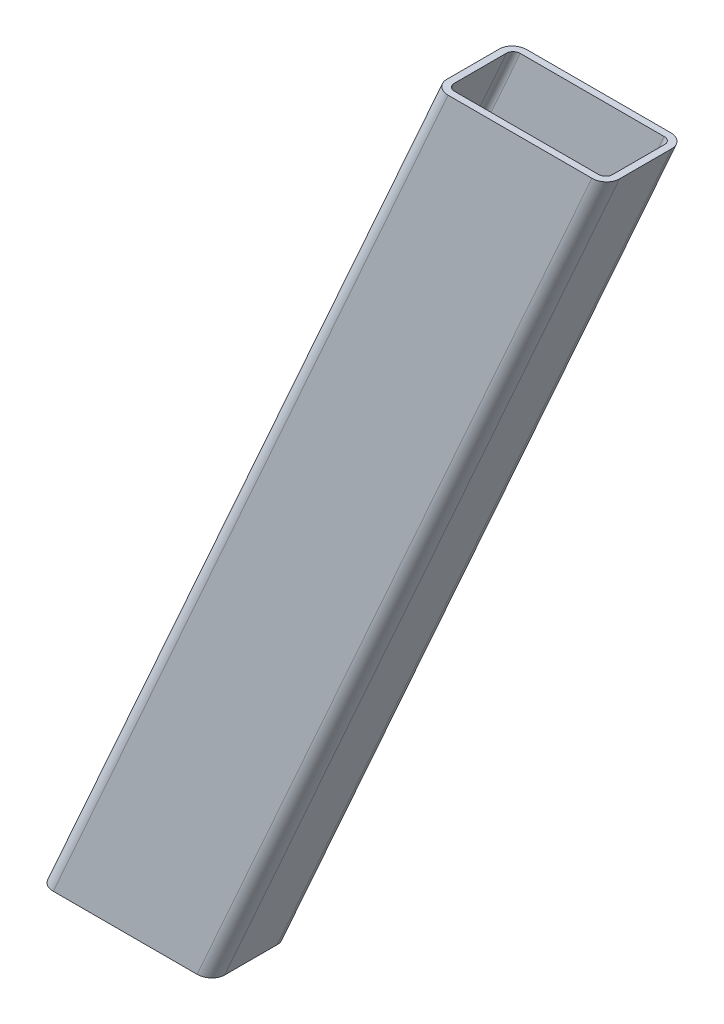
ISO-10303-21;
HEADER;
FILE_DESCRIPTION(('STEP AP214'),'2;1');
FILE_NAME('part.step','',(''),(''),'','','');
FILE_SCHEMA(('AUTOMOTIVE_DESIGN { 1 0 10303 214 1 1 1 1 }'));
ENDSEC;
DATA;
#1=APPLICATION_CONTEXT('core data for automotive mechanical design processes');
#2=APPLICATION_PROTOCOL_DEFINITION('international standard','automotive_design',2000,#1);
#3=PRODUCT_CONTEXT('',#1,'mechanical');
#4=PRODUCT('Part','Part','',(#3));
#5=PRODUCT_RELATED_PRODUCT_CATEGORY('part','',(#4));
#6=PRODUCT_DEFINITION_FORMATION('','',#4);
#7=PRODUCT_DEFINITION_CONTEXT('part definition',#1,'design');
#8=PRODUCT_DEFINITION('design','',#6,#7);
#9=PRODUCT_DEFINITION_SHAPE('','',#8);
#10=(LENGTH_UNIT() NAMED_UNIT(*) SI_UNIT(.MILLI.,.METRE.));
#11=(NAMED_UNIT(*) PLANE_ANGLE_UNIT() SI_UNIT($,.RADIAN.));
#12=(NAMED_UNIT(*) SI_UNIT($,.STERADIAN.) SOLID_ANGLE_UNIT());
#13=UNCERTAINTY_MEASURE_WITH_UNIT(LENGTH_MEASURE(1.E-05),#10,'distance_accuracy_value','');
#14=(GEOMETRIC_REPRESENTATION_CONTEXT(3) GLOBAL_UNCERTAINTY_ASSIGNED_CONTEXT((#13)) GLOBAL_UNIT_ASSIGNED_CONTEXT((#10,
#11,#12)) REPRESENTATION_CONTEXT('',''));
#15=CARTESIAN_POINT('',(0.,0.,0.));
#16=DIRECTION('',(0.,0.,1.));
#17=DIRECTION('',(1.,0.,0.));
#18=AXIS2_PLACEMENT_3D('',#15,#16,#17);
#19=CARTESIAN_POINT('',(-943.861745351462,-2097.12163758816,-711.2));
#20=DIRECTION('',(0.,1.,0.));
#21=DIRECTION('',(0.,0.,1.));
#22=AXIS2_PLACEMENT_3D('',#19,#20,#21);
#23=PLANE('',#22);
#24=DIRECTION('',(-1.,0.,0.));
#25=VECTOR('',#24,1.);
#26=CARTESIAN_POINT('',(-457.066527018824,-2097.12163758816,-139.7));
#27=LINE('',#26,#25);
#28=CARTESIAN_POINT('',(-461.664635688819,-2097.12163758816,-139.7));
#29=VERTEX_POINT('',#28);
#30=CARTESIAN_POINT('',(-739.693539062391,-2097.12163758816,-139.700000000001));
#31=VERTEX_POINT('',#30);
#32=EDGE_CURVE('E161',#29,#31,#27,.T.);
#33=ORIENTED_EDGE('',*,*,#32,.T.);
#34=CARTESIAN_POINT('',(-739.693539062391,-2097.12163758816,-127.000000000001));
#35=DIRECTION('',(0.,1.,0.));
#36=DIRECTION('',(1.,0.,0.));
#37=AXIS2_PLACEMENT_3D('',#34,#35,#36);
#38=ELLIPSE('',#37,13.9014451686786,12.7);
#39=CARTESIAN_POINT('',(-753.59498423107,-2097.12163758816,-127.000000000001));
#40=VERTEX_POINT('',#39);
#41=EDGE_CURVE('E13',#31,#40,#38,.T.);
#42=ORIENTED_EDGE('',*,*,#41,.T.);
#43=DIRECTION('',(0.,0.,1.));
#44=VECTOR('',#43,1.);
#45=CARTESIAN_POINT('',(-753.59498423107,-2097.12163758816,-25.4000000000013));
#46=LINE('',#45,#44);
#47=CARTESIAN_POINT('',(-753.59498423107,-2097.12163758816,-25.4000000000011));
#48=VERTEX_POINT('',#47);
#49=EDGE_CURVE('E163',#40,#48,#46,.T.);
#50=ORIENTED_EDGE('',*,*,#49,.T.);
#51=CARTESIAN_POINT('',(-739.693539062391,-2097.12163758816,-25.400000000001));
#52=DIRECTION('',(0.,1.,0.));
#53=DIRECTION('',(1.,0.,0.));
#54=AXIS2_PLACEMENT_3D('',#51,#52,#53);
#55=ELLIPSE('',#54,13.9014451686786,12.7);
#56=CARTESIAN_POINT('',(-739.693539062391,-2097.12163758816,-12.700000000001));
#57=VERTEX_POINT('',#56);
#58=EDGE_CURVE('E165',#48,#57,#55,.T.);
#59=ORIENTED_EDGE('',*,*,#58,.T.);
#60=DIRECTION('',(1.,0.,0.));
#61=VECTOR('',#60,1.);
#62=CARTESIAN_POINT('',(-689.114343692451,-2097.12163758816,-12.7000000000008));
#63=LINE('',#62,#61);
#64=CARTESIAN_POINT('',(-461.664635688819,-2097.12163758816,-12.7000000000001));
#65=VERTEX_POINT('',#64);
#66=EDGE_CURVE('E167',#57,#65,#63,.T.);
#67=ORIENTED_EDGE('',*,*,#66,.T.);
#68=CARTESIAN_POINT('',(-461.664635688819,-2097.12163758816,-25.4000000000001));
#69=DIRECTION('',(0.,1.,0.));
#70=DIRECTION('',(1.,0.,0.));
#71=AXIS2_PLACEMENT_3D('',#68,#69,#70);
#72=ELLIPSE('',#71,13.9014451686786,12.7);
#73=CARTESIAN_POINT('',(-447.763190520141,-2097.12163758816,-25.4000000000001));
#74=VERTEX_POINT('',#73);
#75=EDGE_CURVE('E105',#65,#74,#72,.T.);
#76=ORIENTED_EDGE('',*,*,#75,.T.);
#77=DIRECTION('',(0.,0.,-1.));
#78=VECTOR('',#77,1.);
#79=CARTESIAN_POINT('',(-447.76319052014,-2097.12163758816,-127.));
#80=LINE('',#79,#78);
#81=CARTESIAN_POINT('',(-447.76319052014,-2097.12163758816,-127.));
#82=VERTEX_POINT('',#81);
#83=EDGE_CURVE('E109',#74,#82,#80,.T.);
#84=ORIENTED_EDGE('',*,*,#83,.T.);
#85=CARTESIAN_POINT('',(-461.664635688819,-2097.12163758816,-127.));
#86=DIRECTION('',(0.,1.,0.));
#87=DIRECTION('',(1.,0.,0.));
#88=AXIS2_PLACEMENT_3D('',#85,#86,#87);
#89=ELLIPSE('',#88,13.9014451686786,12.7);
#90=EDGE_CURVE('E114',#82,#29,#89,.T.);
#91=ORIENTED_EDGE('',*,*,#90,.T.);
#92=EDGE_LOOP('',(#33,#42,#50,#59,#67,#76,#84,#91));
#93=FACE_BOUND('',#92,.T.);
#94=DIRECTION('',(1.,0.,0.));
#95=VECTOR('',#94,1.);
#96=CARTESIAN_POINT('',(-689.114343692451,-2097.12163758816,-7.95989374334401E-13));
#97=LINE('',#96,#95);
#98=CARTESIAN_POINT('',(-739.693539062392,-2097.12163758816,-9.57567358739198E-13));
#99=VERTEX_POINT('',#98);
#100=CARTESIAN_POINT('',(-461.664635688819,-2097.12163758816,0.));
#101=VERTEX_POINT('',#100);
#102=EDGE_CURVE('E156',#99,#101,#97,.T.);
#103=ORIENTED_EDGE('',*,*,#102,.F.);
#104=CARTESIAN_POINT('',(-739.693539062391,-2097.12163758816,-25.400000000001));
#105=DIRECTION('',(0.,1.,0.));
#106=DIRECTION('',(1.,0.,0.));
#107=AXIS2_PLACEMENT_3D('',#104,#105,#106);
#108=ELLIPSE('',#107,27.8028903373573,25.4);
#109=CARTESIAN_POINT('',(-767.496429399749,-2097.12163758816,-25.4000000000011));
#110=VERTEX_POINT('',#109);
#111=EDGE_CURVE('E66',#110,#99,#108,.T.);
#112=ORIENTED_EDGE('',*,*,#111,.F.);
#113=DIRECTION('',(0.,0.,1.));
#114=VECTOR('',#113,1.);
#115=CARTESIAN_POINT('',(-767.496429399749,-2097.12163758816,-25.4000000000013));
#116=LINE('',#115,#114);
#117=CARTESIAN_POINT('',(-767.496429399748,-2097.12163758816,-127.000000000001));
#118=VERTEX_POINT('',#117);
#119=EDGE_CURVE('E72',#118,#110,#116,.T.);
#120=ORIENTED_EDGE('',*,*,#119,.F.);
#121=CARTESIAN_POINT('',(-739.693539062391,-2097.12163758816,-127.000000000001));
#122=DIRECTION('',(0.,1.,0.));
#123=DIRECTION('',(1.,0.,0.));
#124=AXIS2_PLACEMENT_3D('',#121,#122,#123);
#125=ELLIPSE('',#124,27.8028903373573,25.4);
#126=CARTESIAN_POINT('',(-739.693539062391,-2097.12163758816,-152.400000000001));
#127=VERTEX_POINT('',#126);
#128=EDGE_CURVE('E125',#127,#118,#125,.T.);
#129=ORIENTED_EDGE('',*,*,#128,.F.);
#130=DIRECTION('',(-1.,0.,0.));
#131=VECTOR('',#130,1.);
#132=CARTESIAN_POINT('',(-457.066527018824,-2097.12163758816,-152.4));
#133=LINE('',#132,#131);
#134=CARTESIAN_POINT('',(-461.664635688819,-2097.12163758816,-152.4));
#135=VERTEX_POINT('',#134);
#136=EDGE_CURVE('E129',#135,#127,#133,.T.);
#137=ORIENTED_EDGE('',*,*,#136,.F.);
#138=CARTESIAN_POINT('',(-461.664635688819,-2097.12163758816,-127.));
#139=DIRECTION('',(0.,1.,0.));
#140=DIRECTION('',(1.,0.,0.));
#141=AXIS2_PLACEMENT_3D('',#138,#139,#140);
#142=ELLIPSE('',#141,27.8028903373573,25.4000000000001);
#143=CARTESIAN_POINT('',(-433.861745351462,-2097.12163758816,-127.));
#144=VERTEX_POINT('',#143);
#145=EDGE_CURVE('E133',#144,#135,#142,.T.);
#146=ORIENTED_EDGE('',*,*,#145,.F.);
#147=DIRECTION('',(0.,0.,-1.));
#148=VECTOR('',#147,1.);
#149=CARTESIAN_POINT('',(-433.861745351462,-2097.12163758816,-127.));
#150=LINE('',#149,#148);
#151=CARTESIAN_POINT('',(-433.861745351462,-2097.12163758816,-25.4));
#152=VERTEX_POINT('',#151);
#153=EDGE_CURVE('E247',#152,#144,#150,.T.);
#154=ORIENTED_EDGE('',*,*,#153,.F.);
#155=CARTESIAN_POINT('',(-461.664635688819,-2097.12163758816,-25.4000000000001));
#156=DIRECTION('',(0.,1.,0.));
#157=DIRECTION('',(1.,0.,0.));
#158=AXIS2_PLACEMENT_3D('',#155,#156,#157);
#159=ELLIPSE('',#158,27.8028903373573,25.4000000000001);
#160=EDGE_CURVE('E81',#101,#152,#159,.T.);
#161=ORIENTED_EDGE('',*,*,#160,.F.);
#162=EDGE_LOOP('',(#103,#112,#120,#129,#137,#146,#154,#161));
#163=FACE_BOUND('',#162,.T.);
#164=ADVANCED_FACE('F62',(#93,#163),#23,.F.);
#165=CARTESIAN_POINT('',(-689.114343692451,-1983.49738383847,-9.57567358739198E-13));
#166=DIRECTION('',(0.,0.,-1.));
#167=DIRECTION('',(-1.,0.,0.));
#168=AXIS2_PLACEMENT_3D('',#165,#166,#167);
#169=PLANE('',#168);
#170=DIRECTION('',(0.406672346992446,0.913574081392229,0.));
#171=VECTOR('',#170,1.);
#172=CARTESIAN_POINT('',(-457.066527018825,-2086.79215997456,0.));
#173=LINE('',#172,#171);
#174=CARTESIAN_POINT('',(301.535364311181,-382.621637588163,0.));
#175=VERTEX_POINT('',#174);
#176=EDGE_CURVE('E148',#101,#175,#173,.T.);
#177=ORIENTED_EDGE('',*,*,#176,.T.);
#178=DIRECTION('',(-1.,0.,0.));
#179=VECTOR('',#178,1.);
#180=CARTESIAN_POINT('',(-689.114343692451,-382.621637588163,-3.23407319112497E-12));
#181=LINE('',#180,#179);
#182=CARTESIAN_POINT('',(23.5064609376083,-382.621637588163,-9.57567358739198E-13));
#183=VERTEX_POINT('',#182);
#184=EDGE_CURVE('E242',#175,#183,#181,.T.);
#185=ORIENTED_EDGE('',*,*,#184,.T.);
#186=DIRECTION('',(0.406672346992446,0.913574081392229,0.));
#187=VECTOR('',#186,1.);
#188=CARTESIAN_POINT('',(-689.114343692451,-1983.49738383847,-9.57567358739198E-13));
#189=LINE('',#188,#187);
#190=EDGE_CURVE('E176',#99,#183,#189,.T.);
#191=ORIENTED_EDGE('',*,*,#190,.F.);
#192=ORIENTED_EDGE('',*,*,#102,.T.);
#193=EDGE_LOOP('',(#177,#185,#191,#192));
#194=FACE_BOUND('',#193,.T.);
#195=ADVANCED_FACE('F64',(#194),#169,.F.);
#196=CARTESIAN_POINT('',(-457.066527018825,-2086.79215997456,-25.4000000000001));
#197=DIRECTION('',(0.406672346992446,0.913574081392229,0.));
#198=DIRECTION('',(-0.913574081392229,0.406672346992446,0.));
#199=AXIS2_PLACEMENT_3D('',#196,#197,#198);
#200=CYLINDRICAL_SURFACE('',#199,25.4000000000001);
#201=ORIENTED_EDGE('',*,*,#160,.T.);
#202=DIRECTION('',(0.406672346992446,0.913574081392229,0.));
#203=VECTOR('',#202,1.);
#204=CARTESIAN_POINT('',(-433.861745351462,-2097.12163758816,-25.4));
#205=LINE('',#204,#203);
#206=CARTESIAN_POINT('',(329.338254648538,-382.621637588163,-25.4));
#207=VERTEX_POINT('',#206);
#208=EDGE_CURVE('E243',#152,#207,#205,.T.);
#209=ORIENTED_EDGE('',*,*,#208,.T.);
#210=CARTESIAN_POINT('',(301.535364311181,-382.621637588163,-25.4000000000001));
#211=DIRECTION('',(0.,-1.,0.));
#212=DIRECTION('',(1.,0.,0.));
#213=AXIS2_PLACEMENT_3D('',#210,#211,#212);
#214=ELLIPSE('',#213,27.8028903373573,25.4000000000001);
#215=EDGE_CURVE('E246',#207,#175,#214,.T.);
#216=ORIENTED_EDGE('',*,*,#215,.T.);
#217=ORIENTED_EDGE('',*,*,#176,.F.);
#218=EDGE_LOOP('',(#201,#209,#216,#217));
#219=FACE_BOUND('',#218,.T.);
#220=ADVANCED_FACE('F326',(#219),#200,.T.);
#221=CARTESIAN_POINT('',(-457.066527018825,-2086.79215997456,-127.));
#222=DIRECTION('',(0.406672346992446,0.913574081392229,0.));
#223=DIRECTION('',(-0.913574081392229,0.406672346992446,0.));
#224=AXIS2_PLACEMENT_3D('',#221,#222,#223);
#225=CYLINDRICAL_SURFACE('',#224,25.4000000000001);
#226=DIRECTION('',(0.406672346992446,0.913574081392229,0.));
#227=VECTOR('',#226,1.);
#228=CARTESIAN_POINT('',(-457.066527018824,-2086.79215997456,-152.4));
#229=LINE('',#228,#227);
#230=CARTESIAN_POINT('',(301.535364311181,-382.621637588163,-152.4));
#231=VERTEX_POINT('',#230);
#232=EDGE_CURVE('E139',#135,#231,#229,.T.);
#233=ORIENTED_EDGE('',*,*,#232,.T.);
#234=CARTESIAN_POINT('',(301.535364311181,-382.621637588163,-127.));
#235=DIRECTION('',(0.,-1.,0.));
#236=DIRECTION('',(1.,0.,0.));
#237=AXIS2_PLACEMENT_3D('',#234,#235,#236);
#238=ELLIPSE('',#237,27.8028903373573,25.4000000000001);
#239=CARTESIAN_POINT('',(329.338254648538,-382.621637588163,-127.));
#240=VERTEX_POINT('',#239);
#241=EDGE_CURVE('E261',#231,#240,#238,.T.);
#242=ORIENTED_EDGE('',*,*,#241,.T.);
#243=DIRECTION('',(0.406672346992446,0.913574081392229,0.));
#244=VECTOR('',#243,1.);
#245=CARTESIAN_POINT('',(-433.861745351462,-2097.12163758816,-127.));
#246=LINE('',#245,#244);
#247=EDGE_CURVE('E153',#144,#240,#246,.T.);
#248=ORIENTED_EDGE('',*,*,#247,.F.);
#249=ORIENTED_EDGE('',*,*,#145,.T.);
#250=EDGE_LOOP('',(#233,#242,#248,#249));
#251=FACE_BOUND('',#250,.T.);
#252=ADVANCED_FACE('F151',(#251),#225,.T.);
#253=CARTESIAN_POINT('',(-457.066527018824,-2086.79215997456,-152.4));
#254=DIRECTION('',(0.,0.,1.));
#255=DIRECTION('',(1.,0.,0.));
#256=AXIS2_PLACEMENT_3D('',#253,#254,#255);
#257=PLANE('',#256);
#258=DIRECTION('',(0.406672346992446,0.913574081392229,0.));
#259=VECTOR('',#258,1.);
#260=CARTESIAN_POINT('',(-689.11434369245,-1983.49738383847,-152.400000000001));
#261=LINE('',#260,#259);
#262=CARTESIAN_POINT('',(23.506460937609,-382.621637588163,-152.400000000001));
#263=VERTEX_POINT('',#262);
#264=EDGE_CURVE('E147',#127,#263,#261,.T.);
#265=ORIENTED_EDGE('',*,*,#264,.T.);
#266=DIRECTION('',(1.,0.,0.));
#267=VECTOR('',#266,1.);
#268=CARTESIAN_POINT('',(-457.066527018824,-382.621637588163,-152.400000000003));
#269=LINE('',#268,#267);
#270=EDGE_CURVE('E143',#263,#231,#269,.T.);
#271=ORIENTED_EDGE('',*,*,#270,.T.);
#272=ORIENTED_EDGE('',*,*,#232,.F.);
#273=ORIENTED_EDGE('',*,*,#136,.T.);
#274=EDGE_LOOP('',(#265,#271,#272,#273));
#275=FACE_BOUND('',#274,.T.);
#276=ADVANCED_FACE('F140',(#275),#257,.F.);
#277=CARTESIAN_POINT('',(-689.114343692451,-1983.49738383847,-127.000000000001));
#278=DIRECTION('',(0.406672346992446,0.913574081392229,0.));
#279=DIRECTION('',(-0.913574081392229,0.406672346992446,0.));
#280=AXIS2_PLACEMENT_3D('',#277,#278,#279);
#281=CYLINDRICAL_SURFACE('',#280,25.4);
#282=DIRECTION('',(0.406672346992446,0.913574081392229,0.));
#283=VECTOR('',#282,1.);
#284=CARTESIAN_POINT('',(-712.319125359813,-1973.16790622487,-127.000000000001));
#285=LINE('',#284,#283);
#286=CARTESIAN_POINT('',(-4.29642939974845,-382.621637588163,-127.000000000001));
#287=VERTEX_POINT('',#286);
#288=EDGE_CURVE('E177',#118,#287,#285,.T.);
#289=ORIENTED_EDGE('',*,*,#288,.T.);
#290=CARTESIAN_POINT('',(23.5064609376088,-382.621637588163,-127.000000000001));
#291=DIRECTION('',(0.,-1.,0.));
#292=DIRECTION('',(1.,0.,0.));
#293=AXIS2_PLACEMENT_3D('',#290,#291,#292);
#294=ELLIPSE('',#293,27.8028903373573,25.4);
#295=EDGE_CURVE('E256',#287,#263,#294,.T.);
#296=ORIENTED_EDGE('',*,*,#295,.T.);
#297=ORIENTED_EDGE('',*,*,#264,.F.);
#298=ORIENTED_EDGE('',*,*,#128,.T.);
#299=EDGE_LOOP('',(#289,#296,#297,#298));
#300=FACE_BOUND('',#299,.T.);
#301=ADVANCED_FACE('F250',(#300),#281,.T.);
#302=CARTESIAN_POINT('',(-712.319125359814,-1973.16790622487,-25.4000000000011));
#303=DIRECTION('',(0.913574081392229,-0.406672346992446,0.));
#304=DIRECTION('',(0.406672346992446,0.913574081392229,0.));
#305=AXIS2_PLACEMENT_3D('',#302,#303,#304);
#306=PLANE('',#305);
#307=DIRECTION('',(0.406672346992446,0.913574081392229,0.));
#308=VECTOR('',#307,1.);
#309=CARTESIAN_POINT('',(-712.319125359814,-1973.16790622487,-25.4000000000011));
#310=LINE('',#309,#308);
#311=CARTESIAN_POINT('',(-4.29642939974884,-382.621637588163,-25.4000000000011));
#312=VERTEX_POINT('',#311);
#313=EDGE_CURVE('E173',#110,#312,#310,.T.);
#314=ORIENTED_EDGE('',*,*,#313,.T.);
#315=DIRECTION('',(0.,0.,-1.));
#316=VECTOR('',#315,1.);
#317=CARTESIAN_POINT('',(-4.29642939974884,-382.621637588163,-25.3999999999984));
#318=LINE('',#317,#316);
#319=EDGE_CURVE('E263',#312,#287,#318,.T.);
#320=ORIENTED_EDGE('',*,*,#319,.T.);
#321=ORIENTED_EDGE('',*,*,#288,.F.);
#322=ORIENTED_EDGE('',*,*,#119,.T.);
#323=EDGE_LOOP('',(#314,#320,#321,#322));
#324=FACE_BOUND('',#323,.T.);
#325=ADVANCED_FACE('F308',(#324),#306,.F.);
#326=CARTESIAN_POINT('',(-689.114343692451,-1983.49738383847,-25.400000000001));
#327=DIRECTION('',(0.406672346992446,0.913574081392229,0.));
#328=DIRECTION('',(-0.913574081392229,0.406672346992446,0.));
#329=AXIS2_PLACEMENT_3D('',#326,#327,#328);
#330=CYLINDRICAL_SURFACE('',#329,25.4);
#331=ORIENTED_EDGE('',*,*,#190,.T.);
#332=CARTESIAN_POINT('',(23.5064609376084,-382.621637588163,-25.400000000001));
#333=DIRECTION('',(0.,-1.,0.));
#334=DIRECTION('',(1.,0.,0.));
#335=AXIS2_PLACEMENT_3D('',#332,#333,#334);
#336=ELLIPSE('',#335,27.8028903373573,25.4);
#337=EDGE_CURVE('E206',#183,#312,#336,.T.);
#338=ORIENTED_EDGE('',*,*,#337,.T.);
#339=ORIENTED_EDGE('',*,*,#313,.F.);
#340=ORIENTED_EDGE('',*,*,#111,.T.);
#341=EDGE_LOOP('',(#331,#338,#339,#340));
#342=FACE_BOUND('',#341,.T.);
#343=ADVANCED_FACE('F315',(#342),#330,.T.);
#344=CARTESIAN_POINT('',(-457.066527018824,-2086.79215997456,-139.7));
#345=DIRECTION('',(0.,0.,1.));
#346=DIRECTION('',(1.,0.,0.));
#347=AXIS2_PLACEMENT_3D('',#344,#345,#346);
#348=PLANE('',#347);
#349=DIRECTION('',(0.406672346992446,0.913574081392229,0.));
#350=VECTOR('',#349,1.);
#351=CARTESIAN_POINT('',(-457.066527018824,-2086.79215997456,-139.7));
#352=LINE('',#351,#350);
#353=CARTESIAN_POINT('',(301.535364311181,-382.621637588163,-139.7));
#354=VERTEX_POINT('',#353);
#355=EDGE_CURVE('E204',#29,#354,#352,.T.);
#356=ORIENTED_EDGE('',*,*,#355,.T.);
#357=DIRECTION('',(1.,0.,0.));
#358=VECTOR('',#357,1.);
#359=CARTESIAN_POINT('',(-457.066527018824,-382.621637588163,-139.700000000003));
#360=LINE('',#359,#358);
#361=CARTESIAN_POINT('',(23.506460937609,-382.621637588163,-139.700000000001));
#362=VERTEX_POINT('',#361);
#363=EDGE_CURVE('E223',#362,#354,#360,.T.);
#364=ORIENTED_EDGE('',*,*,#363,.F.);
#365=DIRECTION('',(0.406672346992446,0.913574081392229,0.));
#366=VECTOR('',#365,1.);
#367=CARTESIAN_POINT('',(-689.11434369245,-1983.49738383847,-139.700000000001));
#368=LINE('',#367,#366);
#369=EDGE_CURVE('E183',#31,#362,#368,.T.);
#370=ORIENTED_EDGE('',*,*,#369,.F.);
#371=ORIENTED_EDGE('',*,*,#32,.F.);
#372=EDGE_LOOP('',(#356,#364,#370,#371));
#373=FACE_BOUND('',#372,.T.);
#374=ADVANCED_FACE('F224',(#373),#348,.T.);
#375=CARTESIAN_POINT('',(-457.066527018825,-2086.79215997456,-127.));
#376=DIRECTION('',(0.406672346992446,0.913574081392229,0.));
#377=DIRECTION('',(-0.913574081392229,0.406672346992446,0.));
#378=AXIS2_PLACEMENT_3D('',#375,#376,#377);
#379=CYLINDRICAL_SURFACE('',#378,12.7);
#380=DIRECTION('',(0.406672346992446,0.913574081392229,0.));
#381=VECTOR('',#380,1.);
#382=CARTESIAN_POINT('',(-445.464136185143,-2091.95689878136,-127.));
#383=LINE('',#382,#381);
#384=CARTESIAN_POINT('',(315.43680947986,-382.621637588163,-127.));
#385=VERTEX_POINT('',#384);
#386=EDGE_CURVE('E201',#82,#385,#383,.T.);
#387=ORIENTED_EDGE('',*,*,#386,.T.);
#388=CARTESIAN_POINT('',(301.535364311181,-382.621637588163,-127.));
#389=DIRECTION('',(0.,-1.,0.));
#390=DIRECTION('',(1.,0.,0.));
#391=AXIS2_PLACEMENT_3D('',#388,#389,#390);
#392=ELLIPSE('',#391,13.9014451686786,12.7);
#393=EDGE_CURVE('E230',#354,#385,#392,.T.);
#394=ORIENTED_EDGE('',*,*,#393,.F.);
#395=ORIENTED_EDGE('',*,*,#355,.F.);
#396=ORIENTED_EDGE('',*,*,#90,.F.);
#397=EDGE_LOOP('',(#387,#394,#395,#396));
#398=FACE_BOUND('',#397,.T.);
#399=ADVANCED_FACE('F284',(#398),#379,.F.);
#400=CARTESIAN_POINT('',(-445.464136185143,-2091.95689878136,-127.));
#401=DIRECTION('',(-0.913574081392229,0.406672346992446,0.));
#402=DIRECTION('',(-0.406672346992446,-0.913574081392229,0.));
#403=AXIS2_PLACEMENT_3D('',#400,#401,#402);
#404=PLANE('',#403);
#405=DIRECTION('',(0.406672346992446,0.913574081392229,0.));
#406=VECTOR('',#405,1.);
#407=CARTESIAN_POINT('',(-445.464136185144,-2091.95689878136,-25.4000000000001));
#408=LINE('',#407,#406);
#409=CARTESIAN_POINT('',(315.436809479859,-382.621637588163,-25.4000000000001));
#410=VERTEX_POINT('',#409);
#411=EDGE_CURVE('E198',#74,#410,#408,.T.);
#412=ORIENTED_EDGE('',*,*,#411,.T.);
#413=DIRECTION('',(0.,0.,1.));
#414=VECTOR('',#413,1.);
#415=CARTESIAN_POINT('',(315.43680947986,-382.621637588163,-126.999999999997));
#416=LINE('',#415,#414);
#417=EDGE_CURVE('E277',#385,#410,#416,.T.);
#418=ORIENTED_EDGE('',*,*,#417,.F.);
#419=ORIENTED_EDGE('',*,*,#386,.F.);
#420=ORIENTED_EDGE('',*,*,#83,.F.);
#421=EDGE_LOOP('',(#412,#418,#419,#420));
#422=FACE_BOUND('',#421,.T.);
#423=ADVANCED_FACE('F356',(#422),#404,.T.);
#424=CARTESIAN_POINT('',(-457.066527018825,-2086.79215997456,-25.4000000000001));
#425=DIRECTION('',(0.406672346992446,0.913574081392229,0.));
#426=DIRECTION('',(-0.913574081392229,0.406672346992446,0.));
#427=AXIS2_PLACEMENT_3D('',#424,#425,#426);
#428=CYLINDRICAL_SURFACE('',#427,12.7);
#429=DIRECTION('',(0.406672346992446,0.913574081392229,0.));
#430=VECTOR('',#429,1.);
#431=CARTESIAN_POINT('',(-457.066527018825,-2086.79215997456,-12.7000000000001));
#432=LINE('',#431,#430);
#433=CARTESIAN_POINT('',(301.535364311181,-382.621637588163,-12.7000000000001));
#434=VERTEX_POINT('',#433);
#435=EDGE_CURVE('E195',#65,#434,#432,.T.);
#436=ORIENTED_EDGE('',*,*,#435,.T.);
#437=CARTESIAN_POINT('',(301.535364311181,-382.621637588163,-25.4000000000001));
#438=DIRECTION('',(0.,-1.,0.));
#439=DIRECTION('',(1.,0.,0.));
#440=AXIS2_PLACEMENT_3D('',#437,#438,#439);
#441=ELLIPSE('',#440,13.9014451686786,12.7);
#442=EDGE_CURVE('E274',#410,#434,#441,.T.);
#443=ORIENTED_EDGE('',*,*,#442,.F.);
#444=ORIENTED_EDGE('',*,*,#411,.F.);
#445=ORIENTED_EDGE('',*,*,#75,.F.);
#446=EDGE_LOOP('',(#436,#443,#444,#445));
#447=FACE_BOUND('',#446,.T.);
#448=ADVANCED_FACE('F352',(#447),#428,.F.);
#449=CARTESIAN_POINT('',(-689.114343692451,-1983.49738383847,-12.700000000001));
#450=DIRECTION('',(0.,0.,-1.));
#451=DIRECTION('',(-1.,0.,0.));
#452=AXIS2_PLACEMENT_3D('',#449,#450,#451);
#453=PLANE('',#452);
#454=DIRECTION('',(0.406672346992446,0.913574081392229,0.));
#455=VECTOR('',#454,1.);
#456=CARTESIAN_POINT('',(-689.114343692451,-1983.49738383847,-12.700000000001));
#457=LINE('',#456,#455);
#458=CARTESIAN_POINT('',(23.5064609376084,-382.621637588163,-12.700000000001));
#459=VERTEX_POINT('',#458);
#460=EDGE_CURVE('E192',#57,#459,#457,.T.);
#461=ORIENTED_EDGE('',*,*,#460,.T.);
#462=DIRECTION('',(-1.,0.,0.));
#463=VECTOR('',#462,1.);
#464=CARTESIAN_POINT('',(-689.114343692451,-382.621637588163,-12.7000000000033));
#465=LINE('',#464,#463);
#466=EDGE_CURVE('E271',#434,#459,#465,.T.);
#467=ORIENTED_EDGE('',*,*,#466,.F.);
#468=ORIENTED_EDGE('',*,*,#435,.F.);
#469=ORIENTED_EDGE('',*,*,#66,.F.);
#470=EDGE_LOOP('',(#461,#467,#468,#469));
#471=FACE_BOUND('',#470,.T.);
#472=ADVANCED_FACE('F348',(#471),#453,.T.);
#473=CARTESIAN_POINT('',(-689.114343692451,-1983.49738383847,-25.400000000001));
#474=DIRECTION('',(0.406672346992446,0.913574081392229,0.));
#475=DIRECTION('',(-0.913574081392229,0.406672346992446,0.));
#476=AXIS2_PLACEMENT_3D('',#473,#474,#475);
#477=CYLINDRICAL_SURFACE('',#476,12.7);
#478=DIRECTION('',(0.406672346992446,0.913574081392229,0.));
#479=VECTOR('',#478,1.);
#480=CARTESIAN_POINT('',(-700.716734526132,-1978.33264503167,-25.4000000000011));
#481=LINE('',#480,#479);
#482=CARTESIAN_POINT('',(9.60501576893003,-382.621637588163,-25.4000000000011));
#483=VERTEX_POINT('',#482);
#484=EDGE_CURVE('E189',#48,#483,#481,.T.);
#485=ORIENTED_EDGE('',*,*,#484,.T.);
#486=CARTESIAN_POINT('',(23.5064609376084,-382.621637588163,-25.400000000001));
#487=DIRECTION('',(0.,-1.,0.));
#488=DIRECTION('',(1.,0.,0.));
#489=AXIS2_PLACEMENT_3D('',#486,#487,#488);
#490=ELLIPSE('',#489,13.9014451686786,12.7);
#491=EDGE_CURVE('E269',#459,#483,#490,.T.);
#492=ORIENTED_EDGE('',*,*,#491,.F.);
#493=ORIENTED_EDGE('',*,*,#460,.F.);
#494=ORIENTED_EDGE('',*,*,#58,.F.);
#495=EDGE_LOOP('',(#485,#492,#493,#494));
#496=FACE_BOUND('',#495,.T.);
#497=ADVANCED_FACE('F344',(#496),#477,.F.);
#498=CARTESIAN_POINT('',(-700.716734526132,-1978.33264503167,-25.4000000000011));
#499=DIRECTION('',(0.913574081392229,-0.406672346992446,0.));
#500=DIRECTION('',(0.406672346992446,0.913574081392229,0.));
#501=AXIS2_PLACEMENT_3D('',#498,#499,#500);
#502=PLANE('',#501);
#503=DIRECTION('',(0.406672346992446,0.913574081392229,0.));
#504=VECTOR('',#503,1.);
#505=CARTESIAN_POINT('',(-700.716734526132,-1978.33264503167,-127.000000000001));
#506=LINE('',#505,#504);
#507=CARTESIAN_POINT('',(9.60501576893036,-382.621637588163,-127.000000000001));
#508=VERTEX_POINT('',#507);
#509=EDGE_CURVE('E186',#40,#508,#506,.T.);
#510=ORIENTED_EDGE('',*,*,#509,.T.);
#511=DIRECTION('',(0.,0.,-1.));
#512=VECTOR('',#511,1.);
#513=CARTESIAN_POINT('',(9.60501576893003,-382.621637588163,-25.3999999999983));
#514=LINE('',#513,#512);
#515=EDGE_CURVE('E236',#483,#508,#514,.T.);
#516=ORIENTED_EDGE('',*,*,#515,.F.);
#517=ORIENTED_EDGE('',*,*,#484,.F.);
#518=ORIENTED_EDGE('',*,*,#49,.F.);
#519=EDGE_LOOP('',(#510,#516,#517,#518));
#520=FACE_BOUND('',#519,.T.);
#521=ADVANCED_FACE('F341',(#520),#502,.T.);
#522=CARTESIAN_POINT('',(-689.114343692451,-1983.49738383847,-127.000000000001));
#523=DIRECTION('',(0.406672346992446,0.913574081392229,0.));
#524=DIRECTION('',(-0.913574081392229,0.406672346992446,0.));
#525=AXIS2_PLACEMENT_3D('',#522,#523,#524);
#526=CYLINDRICAL_SURFACE('',#525,12.7);
#527=ORIENTED_EDGE('',*,*,#369,.T.);
#528=CARTESIAN_POINT('',(23.5064609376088,-382.621637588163,-127.000000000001));
#529=DIRECTION('',(0.,-1.,0.));
#530=DIRECTION('',(1.,0.,0.));
#531=AXIS2_PLACEMENT_3D('',#528,#529,#530);
#532=ELLIPSE('',#531,13.9014451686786,12.7);
#533=EDGE_CURVE('E218',#508,#362,#532,.T.);
#534=ORIENTED_EDGE('',*,*,#533,.F.);
#535=ORIENTED_EDGE('',*,*,#509,.F.);
#536=ORIENTED_EDGE('',*,*,#41,.F.);
#537=EDGE_LOOP('',(#527,#534,#535,#536));
#538=FACE_BOUND('',#537,.T.);
#539=ADVANCED_FACE('F214',(#538),#526,.F.);
#540=CARTESIAN_POINT('',(443.638254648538,-382.621637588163,-584.2));
#541=DIRECTION('',(0.,-1.,0.));
#542=DIRECTION('',(0.,0.,-1.));
#543=AXIS2_PLACEMENT_3D('',#540,#541,#542);
#544=PLANE('',#543);
#545=ORIENTED_EDGE('',*,*,#533,.T.);
#546=ORIENTED_EDGE('',*,*,#363,.T.);
#547=ORIENTED_EDGE('',*,*,#393,.T.);
#548=ORIENTED_EDGE('',*,*,#417,.T.);
#549=ORIENTED_EDGE('',*,*,#442,.T.);
#550=ORIENTED_EDGE('',*,*,#466,.T.);
#551=ORIENTED_EDGE('',*,*,#491,.T.);
#552=ORIENTED_EDGE('',*,*,#515,.T.);
#553=EDGE_LOOP('',(#545,#546,#547,#548,#549,#550,#551,#552));
#554=FACE_BOUND('',#553,.T.);
#555=ORIENTED_EDGE('',*,*,#270,.F.);
#556=ORIENTED_EDGE('',*,*,#295,.F.);
#557=ORIENTED_EDGE('',*,*,#319,.F.);
#558=ORIENTED_EDGE('',*,*,#337,.F.);
#559=ORIENTED_EDGE('',*,*,#184,.F.);
#560=ORIENTED_EDGE('',*,*,#215,.F.);
#561=DIRECTION('',(0.,0.,1.));
#562=VECTOR('',#561,1.);
#563=CARTESIAN_POINT('',(329.338254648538,-382.621637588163,-126.999999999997));
#564=LINE('',#563,#562);
#565=EDGE_CURVE('E241',#240,#207,#564,.T.);
#566=ORIENTED_EDGE('',*,*,#565,.F.);
#567=ORIENTED_EDGE('',*,*,#241,.F.);
#568=EDGE_LOOP('',(#555,#556,#557,#558,#559,#560,#566,#567));
#569=FACE_BOUND('',#568,.T.);
#570=ADVANCED_FACE('F232',(#554,#569),#544,.F.);
#571=CARTESIAN_POINT('',(-433.861745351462,-2097.12163758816,-127.));
#572=DIRECTION('',(-0.913574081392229,0.406672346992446,0.));
#573=DIRECTION('',(-0.406672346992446,-0.913574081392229,0.));
#574=AXIS2_PLACEMENT_3D('',#571,#572,#573);
#575=PLANE('',#574);
#576=ORIENTED_EDGE('',*,*,#247,.T.);
#577=ORIENTED_EDGE('',*,*,#565,.T.);
#578=ORIENTED_EDGE('',*,*,#208,.F.);
#579=ORIENTED_EDGE('',*,*,#153,.T.);
#580=EDGE_LOOP('',(#576,#577,#578,#579));
#581=FACE_BOUND('',#580,.T.);
#582=ADVANCED_FACE('F322',(#581),#575,.F.);
#583=CLOSED_SHELL('',(#164,#195,#220,#252,#276,#301,#325,#343,#374,#399,#423,#448,#472,#497,
#521,#539,#570,#582));
#584=MANIFOLD_SOLID_BREP('B2',#583);
#585=ADVANCED_BREP_SHAPE_REPRESENTATION('',(#18,#584),#14);
#586=SHAPE_DEFINITION_REPRESENTATION(#9,#585);
ENDSEC;
END-ISO-10303-21;
